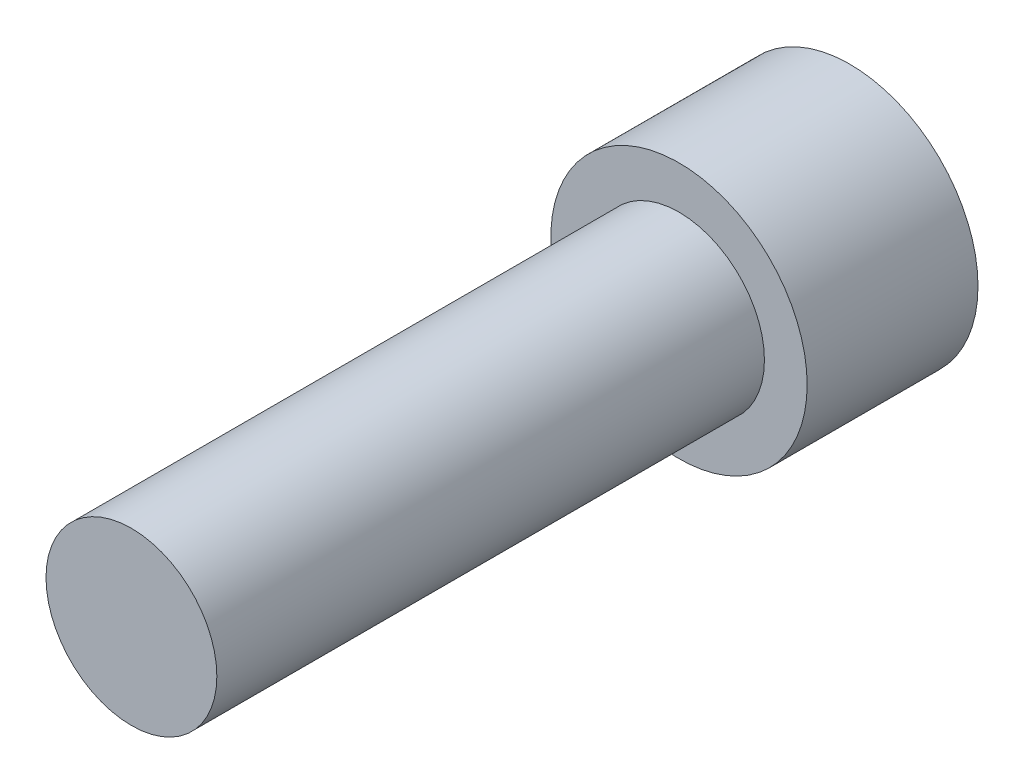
from build123d import *

# Parameters (mm, degrees)
HEX_2_DEPTH = 4.826


with BuildPart() as part:
    # Sketch6 → Revolve1 (revolve)
    with BuildSketch(Plane(origin=(0, 0, 0), x_dir=(0, 0, -1), z_dir=(1, 0, 0)), mode=Mode.PRIVATE) as revolve1_sk:
        Polygon((-25.4, 0), (-25.4, -3.9624), (0, -3.9624), (0, -5.9436), (7.9248, -5.9436), (7.9248, 0), align=None)
    revolve(revolve1_sk.sketch.rotate(Axis((0, 0, 25.4), (0, 0, -1)), 270), axis=Axis((0, 0, 25.4), (0, 0, -1)))

    # Sketch7 → HEX 2 (cut)
    with BuildSketch(Plane(origin=(0, 0, -7.9248), x_dir=(-1, 0, 0), z_dir=(0, 0, -1))):
        Polygon((-3.175, 1.833087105), (-3.175, -1.833087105), (0, -3.666174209), (3.175, -1.833087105), (3.175, 1.833087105), (0, 3.666174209), align=None)
    extrude(amount=-HEX_2_DEPTH, mode=Mode.SUBTRACT)


solid = part.part
